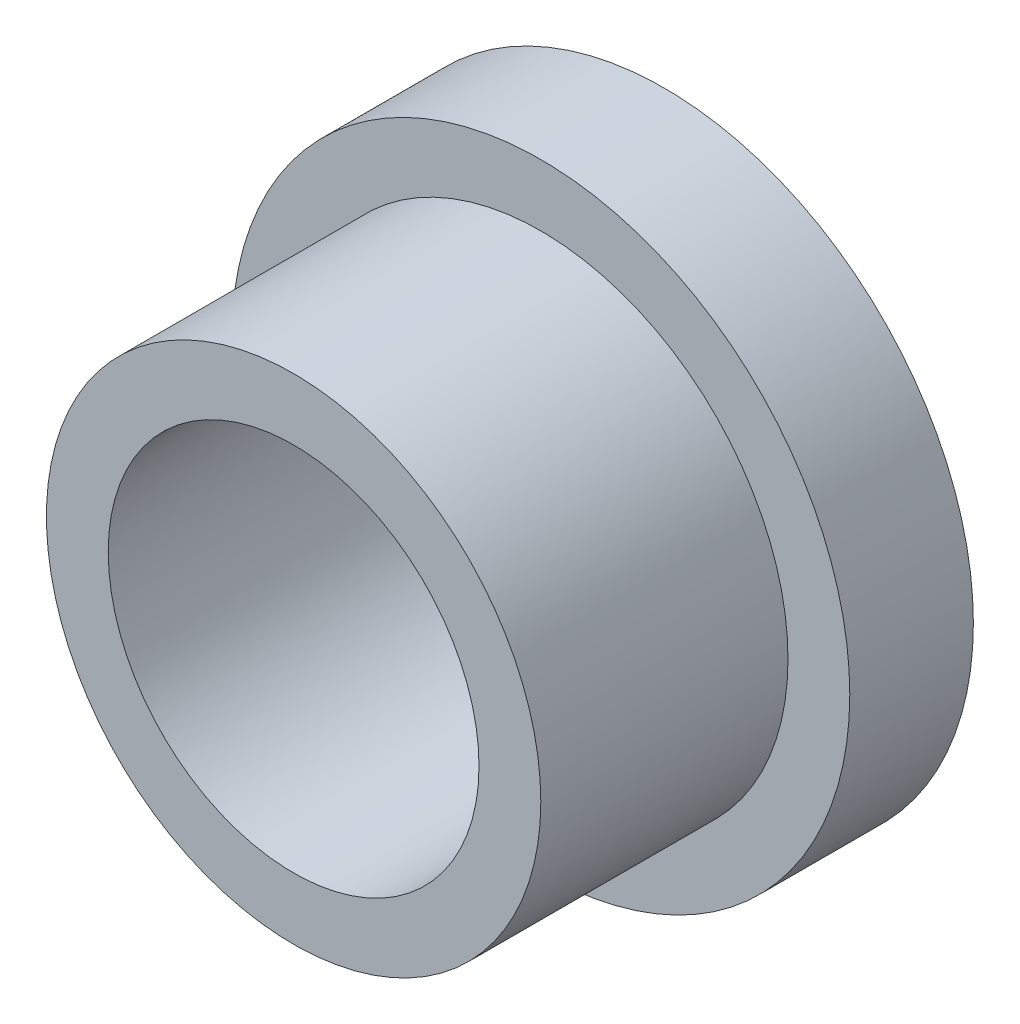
from build123d import *

# Parameters (mm, degrees)
ESQUISSE1_R             = 5
ESQUISSE1_R_2           = 3
EXTRUSION1_DEPTH        = 6
ESQUISSE2_OUTSIDE_W     = 15.072
ESQUISSE2_OUTSIDE_H     = 15.072
ESQUISSE2_OUTSIDE_R     = 4
ENL_V_MAT_EXTRU_1_DEPTH = 4


with BuildPart() as part:
    # Esquisse1 → Extrusion1 (new body)
    with BuildSketch(Plane.XY):
        Circle(ESQUISSE1_R)
        Circle(ESQUISSE1_R_2, mode=Mode.SUBTRACT)
    extrude(amount=EXTRUSION1_DEPTH)

    # Esquisse2 outside → Enl_v. mat.-Extru.1 (cut)
    with BuildSketch(Plane.XY.offset(6)):
        Rectangle(ESQUISSE2_OUTSIDE_W, ESQUISSE2_OUTSIDE_H)
        Circle(ESQUISSE2_OUTSIDE_R, mode=Mode.SUBTRACT)
    extrude(amount=-ENL_V_MAT_EXTRU_1_DEPTH, mode=Mode.SUBTRACT)


solid = part.part
